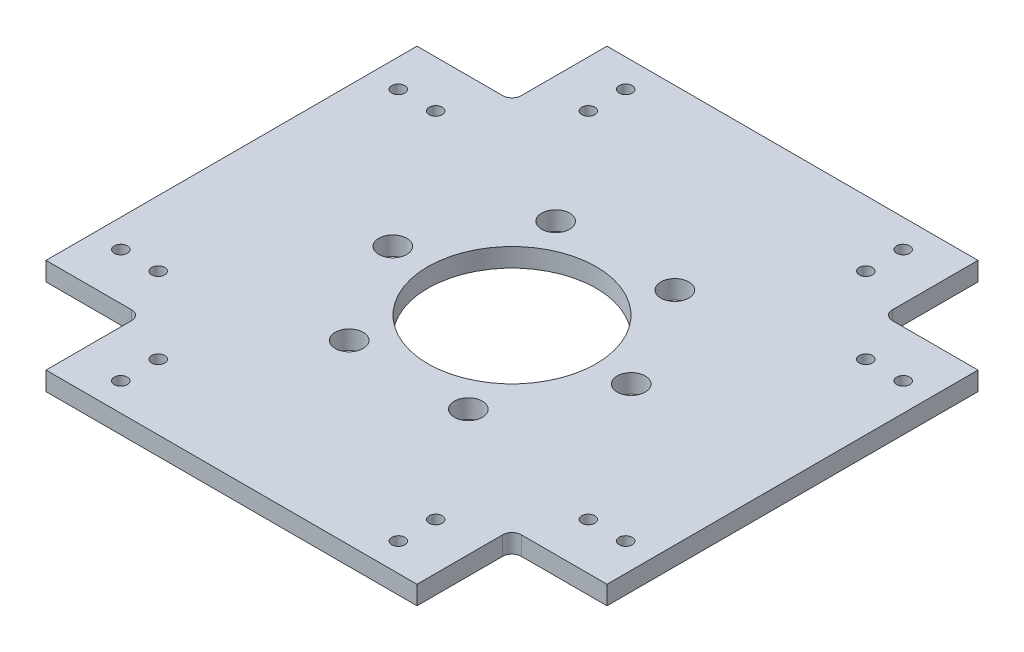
from build123d import *

# Parameters (mm, degrees)
SKETCH1_R           = 45
BOSS_EXTRUDE1_DEPTH = 10
FILLET1_R           = 5
SKETCH2_R           = 6.35
CUT_EXTRUDE1_DEPTH  = 5
CHAMFER1_SIZE       = 1
SKETCH3_R           = 3.5
CUT_EXTRUDE2_DEPTH  = 213.367605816
SKETCH4_R           = 7.5
CUT_EXTRUDE3_DEPTH  = 213.367605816


with BuildPart() as part:
    # Sketch1 → Boss-Extrude1 (new body)
    with BuildSketch(Plane(origin=(0, 0, 0), x_dir=(1, 0, 0), z_dir=(0, 1, 0))):
        Polygon((-99.2, 150), (-99.2, 99.2), (-150, 99.2), (-150, -99.2), (-99.2, -99.2), (-99.2, -150), (99.2, -150), (99.2, -99.2), (150, -99.2), (150, 99.2), (99.2, 99.2), (99.2, 150), align=None)
        with Locations(Location((0, 0, 0), (0, 0, 270))):
            Circle(SKETCH1_R, mode=Mode.SUBTRACT)
    extrude(amount=BOSS_EXTRUDE1_DEPTH)

    # Fillet1
    fillet1_edges = [part.edges().sort_by_distance(p)[0] for p in [
        (-99.2, 5, 99.2),
        (-99.2, 5, -99.2),
        (99.2, 5, -99.2),
        (99.2, 5, 99.2),
    ]]
    fillet(fillet1_edges, radius=FILLET1_R)

    # Sketch2 → Cut-Extrude1 (cut)
    with BuildSketch(Plane.XZ):
        with Locations(Location((40.127920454, -80, 0), (0, 0, 270))):
            Circle(SKETCH2_R)
        with Locations(Location((-40.127920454, -80, 0), (0, 0, 270))):
            Circle(SKETCH2_R)
        with Locations(Location((40.127920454, 80, 0), (0, 0, 270))):
            Circle(SKETCH2_R)
        with Locations(Location((-40.127920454, 80, 0), (0, 0, 270))):
            Circle(SKETCH2_R)
    extrude(amount=-CUT_EXTRUDE1_DEPTH, mode=Mode.SUBTRACT)

    # Chamfer1
    chamfer1_edges = [part.edges().sort_by_distance(p)[0] for p in [
        (-40.127920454, 0, -73.65),
        (40.127920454, 0, 86.35),
        (-40.127920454, 0, 86.35),
        (40.127920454, 0, -73.65),
    ]]
    chamfer(chamfer1_edges, length=CHAMFER1_SIZE)

    # Sketch3 → Cut-Extrude2 (cut, through all)
    with BuildSketch(Plane(origin=(0, 10, 0), x_dir=(1, 0, 0), z_dir=(0, 1, 0))):
        with Locations(Location((-135, 74.19999999, 0), (0, 0, 270))):
            Circle(SKETCH3_R)
        with Locations(Location((-115, 74.19999999, 0), (0, 0, 270))):
            Circle(SKETCH3_R)
        with Locations(Location((-74.19999999, 135, 0), (0, 0, 270))):
            Circle(SKETCH3_R)
        with Locations(Location((-74.19999999, 115, 0), (0, 0, 270))):
            Circle(SKETCH3_R)
        with Locations(Location((74.19999999, 115, 0), (0, 0, 270))):
            Circle(SKETCH3_R)
        with Locations(Location((74.19999999, 135, 0), (0, 0, 270))):
            Circle(SKETCH3_R)
        with Locations(Location((115, 74.19999999, 0), (0, 0, 270))):
            Circle(SKETCH3_R)
        with Locations(Location((135, 74.19999999, 0), (0, 0, 270))):
            Circle(SKETCH3_R)
        with Locations(Location((-74.19999999, -135, 0), (0, 0, 270))):
            Circle(SKETCH3_R)
        with Locations(Location((-74.19999999, -115, 0), (0, 0, 270))):
            Circle(SKETCH3_R)
        with Locations(Location((-135, -74.19999999, 0), (0, 0, 270))):
            Circle(SKETCH3_R)
        with Locations(Location((-115, -74.19999999, 0), (0, 0, 270))):
            Circle(SKETCH3_R)
        with Locations(Location((74.19999999, -115, 0), (0, 0, 270))):
            Circle(SKETCH3_R)
        with Locations(Location((74.19999999, -135, 0), (0, 0, 270))):
            Circle(SKETCH3_R)
        with Locations(Location((115, -74.19999999, 0), (0, 0, 270))):
            Circle(SKETCH3_R)
        with Locations(Location((135, -74.19999999, 0), (0, 0, 270))):
            Circle(SKETCH3_R)
    extrude(amount=-CUT_EXTRUDE2_DEPTH, mode=Mode.SUBTRACT)

    # Sketch4 → Cut-Extrude3 (cut, through all)
    with BuildSketch(Plane.XZ):
        with Locations(Location((-31.875, -55.209119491, 0), (0, 0, 270))):
            Circle(SKETCH4_R)
        with Locations(Location((31.875, -55.209119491, 0), (0, 0, 270))):
            Circle(SKETCH4_R)
        with Locations(Location((63.75, 0, 0), (0, 0, 270))):
            Circle(SKETCH4_R)
        with Locations(Location((31.875, 55.209119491, 0), (0, 0, 270))):
            Circle(SKETCH4_R)
        with Locations(Location((-31.875, 55.209119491, 0), (0, 0, 270))):
            Circle(SKETCH4_R)
        with Locations(Location((-63.75, 0, 0), (0, 0, 270))):
            Circle(SKETCH4_R)
    extrude(amount=-CUT_EXTRUDE3_DEPTH, mode=Mode.SUBTRACT)


solid = part.part
